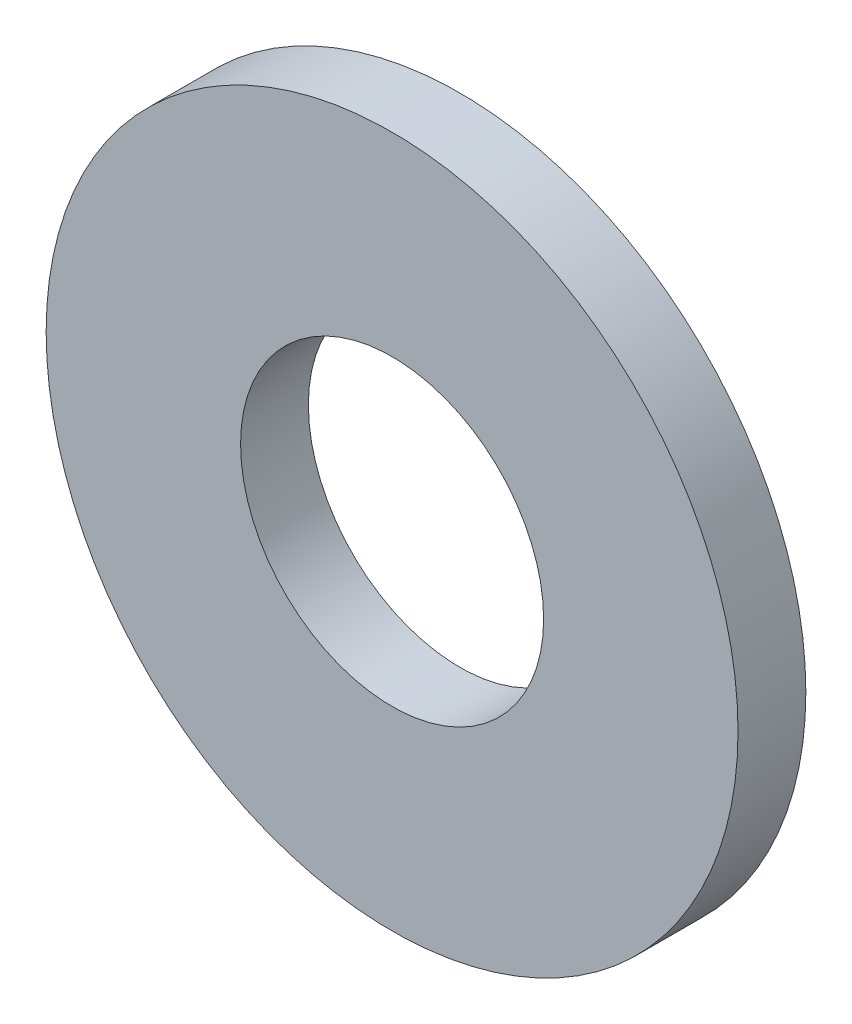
from build123d import *

# Parameters (mm, degrees)
WASHER_SKETCH_R           = 6.35
WASHER_SKETCH_R_2         = 2.7813
WASHER_BASE_EXTRUDE_DEPTH = 1.2446


with BuildPart() as part:
    # Washer Sketch → Washer Base-Extrude (new body)
    with BuildSketch(Plane.XY):
        Circle(WASHER_SKETCH_R)
        Circle(WASHER_SKETCH_R_2, mode=Mode.SUBTRACT)
    extrude(amount=WASHER_BASE_EXTRUDE_DEPTH)


solid = part.part
